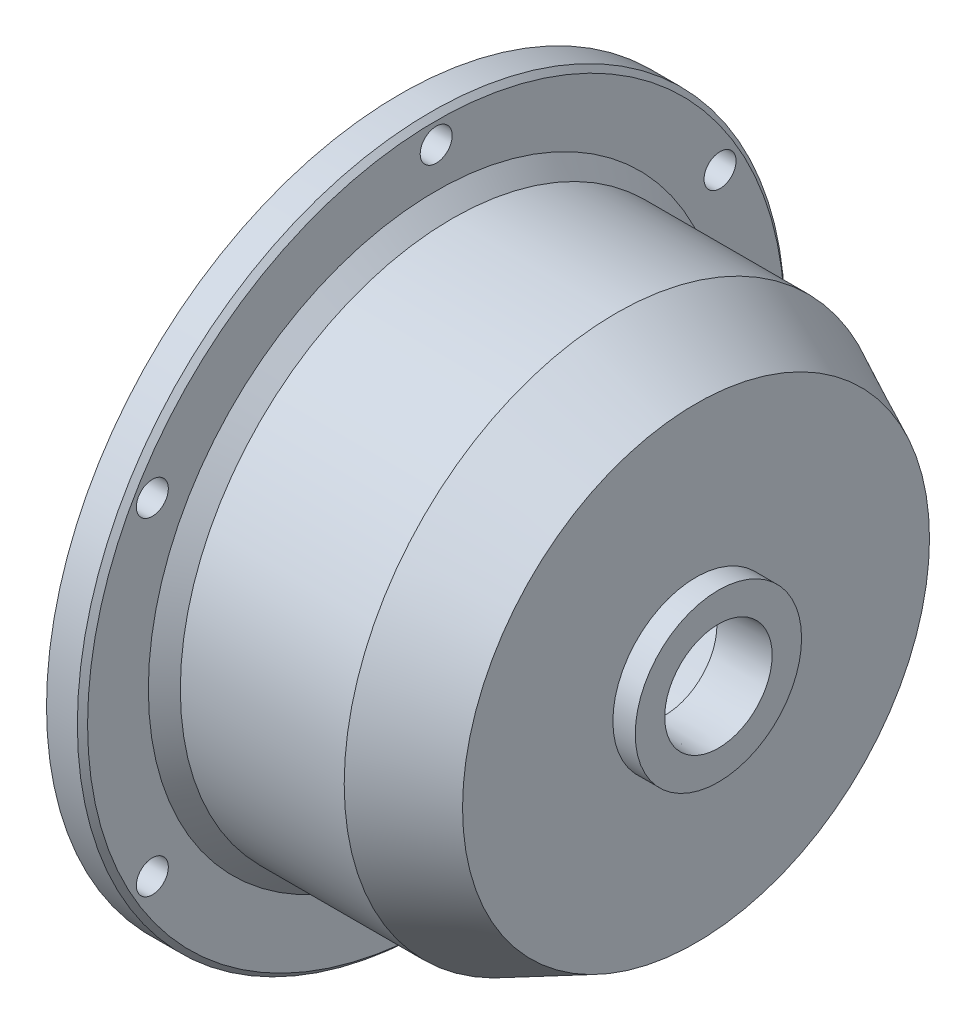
ISO-10303-21;
HEADER;
FILE_DESCRIPTION(('STEP AP214'),'2;1');
FILE_NAME('part.step','',(''),(''),'','','');
FILE_SCHEMA(('AUTOMOTIVE_DESIGN { 1 0 10303 214 1 1 1 1 }'));
ENDSEC;
DATA;
#1=APPLICATION_CONTEXT('core data for automotive mechanical design processes');
#2=APPLICATION_PROTOCOL_DEFINITION('international standard','automotive_design',2000,#1);
#3=PRODUCT_CONTEXT('',#1,'mechanical');
#4=PRODUCT('Part','Part','',(#3));
#5=PRODUCT_RELATED_PRODUCT_CATEGORY('part','',(#4));
#6=PRODUCT_DEFINITION_FORMATION('','',#4);
#7=PRODUCT_DEFINITION_CONTEXT('part definition',#1,'design');
#8=PRODUCT_DEFINITION('design','',#6,#7);
#9=PRODUCT_DEFINITION_SHAPE('','',#8);
#10=(LENGTH_UNIT() NAMED_UNIT(*) SI_UNIT(.MILLI.,.METRE.));
#11=(NAMED_UNIT(*) PLANE_ANGLE_UNIT() SI_UNIT($,.RADIAN.));
#12=(NAMED_UNIT(*) SI_UNIT($,.STERADIAN.) SOLID_ANGLE_UNIT());
#13=UNCERTAINTY_MEASURE_WITH_UNIT(LENGTH_MEASURE(1.E-05),#10,'distance_accuracy_value','');
#14=(GEOMETRIC_REPRESENTATION_CONTEXT(3) GLOBAL_UNCERTAINTY_ASSIGNED_CONTEXT((#13)) GLOBAL_UNIT_ASSIGNED_CONTEXT((#10,
#11,#12)) REPRESENTATION_CONTEXT('',''));
#15=CARTESIAN_POINT('',(0.,0.,0.));
#16=DIRECTION('',(0.,0.,1.));
#17=DIRECTION('',(1.,0.,0.));
#18=AXIS2_PLACEMENT_3D('',#15,#16,#17);
#19=CARTESIAN_POINT('',(68.2497999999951,46.3549999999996,0.));
#20=DIRECTION('',(-1.,0.,0.));
#21=DIRECTION('',(0.,0.,1.));
#22=AXIS2_PLACEMENT_3D('',#19,#20,#21);
#23=PLANE('',#22);
#24=CARTESIAN_POINT('',(68.249799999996,-4.05925293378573E-13,-1.59594559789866E-13));
#25=DIRECTION('',(-1.,0.,0.));
#26=DIRECTION('',(0.,0.,1.));
#27=AXIS2_PLACEMENT_3D('',#24,#25,#26);
#28=CIRCLE('',#27,46.355);
#29=CARTESIAN_POINT('',(68.2497999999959,-3.82947886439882E-13,46.355));
#30=VERTEX_POINT('',#29);
#31=EDGE_CURVE('E186',#30,#30,#28,.T.);
#32=ORIENTED_EDGE('',*,*,#31,.F.);
#33=EDGE_LOOP('',(#32));
#34=FACE_BOUND('',#33,.T.);
#35=CARTESIAN_POINT('',(68.249799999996,-4.05925293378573E-13,-1.59594559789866E-13));
#36=DIRECTION('',(-1.,0.,0.));
#37=DIRECTION('',(0.,0.,1.));
#38=AXIS2_PLACEMENT_3D('',#35,#36,#37);
#39=CIRCLE('',#38,16.51);
#40=CARTESIAN_POINT('',(68.249799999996,-3.97741559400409E-13,16.5099999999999));
#41=VERTEX_POINT('',#40);
#42=EDGE_CURVE('E10',#41,#41,#39,.F.);
#43=ORIENTED_EDGE('',*,*,#42,.F.);
#44=EDGE_LOOP('',(#43));
#45=FACE_BOUND('',#44,.T.);
#46=ADVANCED_FACE('F30',(#34,#45),#23,.F.);
#47=CARTESIAN_POINT('',(-8.88178419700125E-13,0.,0.));
#48=DIRECTION('',(-1.,0.,0.));
#49=DIRECTION('',(0.,0.,1.));
#50=AXIS2_PLACEMENT_3D('',#47,#48,#49);
#51=CYLINDRICAL_SURFACE('',#50,53.975);
#52=CARTESIAN_POINT('',(52.3747999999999,-3.2612801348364E-13,0.));
#53=DIRECTION('',(-1.,0.,0.));
#54=DIRECTION('',(0.,0.,1.));
#55=AXIS2_PLACEMENT_3D('',#52,#53,#54);
#56=CIRCLE('',#55,53.975);
#57=CARTESIAN_POINT('',(52.3747999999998,-2.99373498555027E-13,53.9750000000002));
#58=VERTEX_POINT('',#57);
#59=EDGE_CURVE('E183',#58,#58,#56,.T.);
#60=ORIENTED_EDGE('',*,*,#59,.T.);
#61=EDGE_LOOP('',(#60));
#62=FACE_BOUND('',#61,.T.);
#63=CARTESIAN_POINT('',(19.8373999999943,-1.31838984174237E-13,0.));
#64=DIRECTION('',(-1.,0.,0.));
#65=DIRECTION('',(0.,0.,1.));
#66=AXIS2_PLACEMENT_3D('',#63,#64,#65);
#67=CIRCLE('',#66,53.975);
#68=CARTESIAN_POINT('',(19.8373999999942,-1.05084469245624E-13,53.9750000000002));
#69=VERTEX_POINT('',#68);
#70=EDGE_CURVE('E118',#69,#69,#67,.F.);
#71=ORIENTED_EDGE('',*,*,#70,.T.);
#72=EDGE_LOOP('',(#71));
#73=FACE_BOUND('',#72,.T.);
#74=CARTESIAN_POINT('',(42.849799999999,-53.6001690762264,-6.35000000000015));
#75=CARTESIAN_POINT('',(43.0275402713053,-53.6001684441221,-6.3500019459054));
#76=CARTESIAN_POINT('',(43.205251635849,-53.6010549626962,-6.3425347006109));
#77=CARTESIAN_POINT('',(43.5594611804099,-53.6045743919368,-6.31272249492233));
#78=CARTESIAN_POINT('',(43.735959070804,-53.6072077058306,-6.29037409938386));
#79=CARTESIAN_POINT('',(44.0865558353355,-53.6141486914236,-6.23093702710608));
#80=CARTESIAN_POINT('',(44.2606527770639,-53.6184576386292,-6.19383712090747));
#81=CARTESIAN_POINT('',(44.605140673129,-53.6286275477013,-6.10515548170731));
#82=CARTESIAN_POINT('',(44.7755302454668,-53.6344890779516,-6.05356844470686));
#83=CARTESIAN_POINT('',(45.1111576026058,-53.6475886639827,-5.93635630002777));
#84=CARTESIAN_POINT('',(45.276400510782,-53.6548252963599,-5.87074569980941));
#85=CARTESIAN_POINT('',(45.6008191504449,-53.6704757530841,-5.72590272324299));
#86=CARTESIAN_POINT('',(45.7599926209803,-53.6788900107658,-5.64666533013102));
#87=CARTESIAN_POINT('',(46.0710109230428,-53.6966500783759,-5.47520009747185));
#88=CARTESIAN_POINT('',(46.2228597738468,-53.705995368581,-5.38297949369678));
#89=CARTESIAN_POINT('',(46.5183251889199,-53.7253614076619,-5.18613027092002));
#90=CARTESIAN_POINT('',(46.6619386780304,-53.735382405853,-5.08149706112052));
#91=CARTESIAN_POINT('',(46.9404451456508,-53.7558567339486,-4.86013300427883));
#92=CARTESIAN_POINT('',(47.0753002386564,-53.7663116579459,-4.74335463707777));
#93=CARTESIAN_POINT('',(47.3347553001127,-53.7873239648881,-4.49882932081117));
#94=CARTESIAN_POINT('',(47.4593514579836,-53.7978813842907,-4.37107833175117));
#95=CARTESIAN_POINT('',(47.6973234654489,-53.8187937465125,-4.10557984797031));
#96=CARTESIAN_POINT('',(47.8107028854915,-53.829148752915,-3.96783555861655));
#97=CARTESIAN_POINT('',(48.0255290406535,-53.8493718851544,-3.68322274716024));
#98=CARTESIAN_POINT('',(48.1269713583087,-53.8592398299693,-3.53635087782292));
#99=CARTESIAN_POINT('',(48.3173990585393,-53.8782308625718,-3.23416674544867));
#100=CARTESIAN_POINT('',(48.4063518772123,-53.8873519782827,-3.07883383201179));
#101=CARTESIAN_POINT('',(48.570881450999,-53.9045656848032,-2.76111364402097));
#102=CARTESIAN_POINT('',(48.6464532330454,-53.9126578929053,-2.59872377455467));
#103=CARTESIAN_POINT('',(48.7836029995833,-53.9275762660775,-2.26814345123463));
#104=CARTESIAN_POINT('',(48.8451865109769,-53.9344029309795,-2.09995531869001));
#105=CARTESIAN_POINT('',(48.9539627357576,-53.9466037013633,-1.75891861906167));
#106=CARTESIAN_POINT('',(49.0011501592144,-53.9519772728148,-1.58606836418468));
#107=CARTESIAN_POINT('',(49.120108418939,-53.9656219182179,-1.06411813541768));
#108=CARTESIAN_POINT('',(49.1700680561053,-53.9715060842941,-0.709701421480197));
#109=CARTESIAN_POINT('',(49.209817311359,-53.9761763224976,0.0023380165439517));
#110=CARTESIAN_POINT('',(49.1996090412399,-53.9749626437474,0.359960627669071));
#111=CARTESIAN_POINT('',(49.1196120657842,-53.9656105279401,1.06663214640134));
#112=CARTESIAN_POINT('',(49.0501181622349,-53.9575063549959,1.41571469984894));
#113=CARTESIAN_POINT('',(48.8539618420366,-53.9353193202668,2.09721396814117));
#114=CARTESIAN_POINT('',(48.7272984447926,-53.9212363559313,2.4296303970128));
#115=CARTESIAN_POINT('',(48.4200876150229,-53.8886161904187,3.06929631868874));
#116=CARTESIAN_POINT('',(48.2394116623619,-53.8700683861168,3.37648353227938));
#117=CARTESIAN_POINT('',(47.8293963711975,-53.8305953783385,3.95628707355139));
#118=CARTESIAN_POINT('',(47.6000550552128,-53.8096700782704,4.2289019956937));
#119=CARTESIAN_POINT('',(47.0975658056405,-53.7676364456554,4.7335544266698));
#120=CARTESIAN_POINT('',(46.8241610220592,-53.7465277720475,4.96533623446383));
#121=CARTESIAN_POINT('',(46.2421906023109,-53.7066319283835,5.37975779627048));
#122=CARTESIAN_POINT('',(45.9336248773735,-53.6878447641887,5.56239742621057));
#123=CARTESIAN_POINT('',(45.2898737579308,-53.6547188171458,5.87335982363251));
#124=CARTESIAN_POINT('',(44.9546791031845,-53.6403815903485,6.00166359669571));
#125=CARTESIAN_POINT('',(44.2672966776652,-53.6178098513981,6.20009319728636));
#126=CARTESIAN_POINT('',(43.9151096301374,-53.6095750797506,6.27022149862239));
#127=CARTESIAN_POINT('',(43.2059937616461,-53.6001873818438,6.34997392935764));
#128=CARTESIAN_POINT('',(42.8491058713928,-53.5989924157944,6.35995723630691));
#129=CARTESIAN_POINT('',(42.1387425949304,-53.6037085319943,6.32008258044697));
#130=CARTESIAN_POINT('',(41.7852671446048,-53.6096194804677,6.27022574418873));
#131=CARTESIAN_POINT('',(41.0928296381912,-53.6278430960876,6.11238789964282));
#132=CARTESIAN_POINT('',(40.7538276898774,-53.6401367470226,6.00457951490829));
#133=CARTESIAN_POINT('',(40.0987147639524,-53.6697251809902,5.73407599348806));
#134=CARTESIAN_POINT('',(39.7826045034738,-53.6870201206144,5.57137913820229));
#135=CARTESIAN_POINT('',(39.1806192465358,-53.7247635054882,5.19482900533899));
#136=CARTESIAN_POINT('',(38.8948929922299,-53.7452263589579,4.9807394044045));
#137=CARTESIAN_POINT('',(38.3633012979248,-53.7869540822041,4.50781526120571));
#138=CARTESIAN_POINT('',(38.1174372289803,-53.8082189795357,4.24897918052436));
#139=CARTESIAN_POINT('',(37.6712941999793,-53.849283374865,3.69234862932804));
#140=CARTESIAN_POINT('',(37.4712507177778,-53.8690749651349,3.39436477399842));
#141=CARTESIAN_POINT('',(37.1240556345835,-53.9048450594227,2.76880507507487));
#142=CARTESIAN_POINT('',(36.9769030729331,-53.9208236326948,2.44122976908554));
#143=CARTESIAN_POINT('',(36.7400524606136,-53.9471339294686,1.7666476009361));
#144=CARTESIAN_POINT('',(36.6502163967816,-53.9574792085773,1.41968962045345));
#145=CARTESIAN_POINT('',(36.5301238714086,-53.9714064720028,0.715289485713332));
#146=CARTESIAN_POINT('',(36.4998650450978,-53.9749887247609,0.357847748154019));
#147=CARTESIAN_POINT('',(36.4997677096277,-53.9750056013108,-0.176875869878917));
#148=CARTESIAN_POINT('',(36.5072090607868,-53.9741273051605,-0.354434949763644));
#149=CARTESIAN_POINT('',(36.5369314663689,-53.9706416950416,-0.708271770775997));
#150=CARTESIAN_POINT('',(36.559206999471,-53.96803502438,-0.884549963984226));
#151=CARTESIAN_POINT('',(36.6184508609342,-53.9611618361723,-1.23463975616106));
#152=CARTESIAN_POINT('',(36.6554245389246,-53.9568947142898,-1.40845043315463));
#153=CARTESIAN_POINT('',(36.7437731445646,-53.9468234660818,-1.75226196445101));
#154=CARTESIAN_POINT('',(36.7951428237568,-53.9410198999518,-1.92226418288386));
#155=CARTESIAN_POINT('',(36.9119206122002,-53.9280369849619,-2.2573370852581));
#156=CARTESIAN_POINT('',(36.977329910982,-53.9208575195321,-2.42240734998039));
#157=CARTESIAN_POINT('',(37.1216860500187,-53.9053269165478,-2.7463884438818));
#158=CARTESIAN_POINT('',(37.2006279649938,-53.8969762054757,-2.90530148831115));
#159=CARTESIAN_POINT('',(37.3715342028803,-53.8793308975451,-3.21598328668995));
#160=CARTESIAN_POINT('',(37.4635032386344,-53.8700359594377,-3.36774942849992));
#161=CARTESIAN_POINT('',(37.6597573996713,-53.8507672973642,-3.66297213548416));
#162=CARTESIAN_POINT('',(37.7640380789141,-53.8407938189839,-3.80643167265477));
#163=CARTESIAN_POINT('',(37.9848945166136,-53.8203796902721,-4.08496993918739));
#164=CARTESIAN_POINT('',(38.1015422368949,-53.8099365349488,-4.2199914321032));
#165=CARTESIAN_POINT('',(38.345732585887,-53.7889390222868,-4.47969125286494));
#166=CARTESIAN_POINT('',(38.4732712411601,-53.7783847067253,-4.60437332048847));
#167=CARTESIAN_POINT('',(38.7384702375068,-53.757452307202,-4.84265042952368));
#168=CARTESIAN_POINT('',(38.8761366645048,-53.7470743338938,-4.95623870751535));
#169=CARTESIAN_POINT('',(39.1605093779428,-53.726798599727,-5.17140349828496));
#170=CARTESIAN_POINT('',(39.307212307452,-53.716900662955,-5.27298443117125));
#171=CARTESIAN_POINT('',(39.609255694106,-53.6978254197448,-5.46382704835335));
#172=CARTESIAN_POINT('',(39.764626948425,-53.6886510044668,-5.55304029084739));
#173=CARTESIAN_POINT('',(40.0823365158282,-53.6713315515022,-5.71801314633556));
#174=CARTESIAN_POINT('',(40.2446722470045,-53.663186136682,-5.79377769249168));
#175=CARTESIAN_POINT('',(40.5750862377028,-53.6481616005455,-5.93128720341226));
#176=CARTESIAN_POINT('',(40.7431598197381,-53.6412814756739,-5.99304328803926));
#177=CARTESIAN_POINT('',(41.0839137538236,-53.6289798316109,-6.10214331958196));
#178=CARTESIAN_POINT('',(41.2565929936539,-53.6235579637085,-6.14949071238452));
#179=CARTESIAN_POINT('',(41.6633783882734,-53.612795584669,-6.24273196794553));
#180=CARTESIAN_POINT('',(41.8988327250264,-53.6080805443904,-6.28291693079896));
#181=CARTESIAN_POINT('',(42.3728087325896,-53.6017677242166,-6.33654955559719));
#182=CARTESIAN_POINT('',(42.611330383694,-53.6001699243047,-6.34999738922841));
#183=CARTESIAN_POINT('',(42.849799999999,-53.6001690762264,-6.35000000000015));
#184=B_SPLINE_CURVE_WITH_KNOTS('',3,(#74,#75,#76,#77,#78,#79,#80,#81,#82,#83,#84,#85,#86,#87,
#88,#89,#90,#91,#92,#93,#94,#95,#96,#97,#98,#99,#100,#101,#102,#103,#104,#105,#106,#107,#108,
#109,#110,#111,#112,#113,#114,#115,#116,#117,#118,#119,#120,#121,#122,#123,#124,#125,#126,#127,
#128,#129,#130,#131,#132,#133,#134,#135,#136,#137,#138,#139,#140,#141,#142,#143,#144,#145,#146,
#147,#148,#149,#150,#151,#152,#153,#154,#155,#156,#157,#158,#159,#160,#161,#162,#163,#164,#165,
#166,#167,#168,#169,#170,#171,#172,#173,#174,#175,#176,#177,#178,#179,#180,#181,#182,#183),
.UNSPECIFIED.,.T.,.F.,(4,2,2,2,2,2,2,2,2,2,2,2,2,2,2,2,2,2,2,2,2,2,2,2,2,2,2,2,2,2,2,2,2,2,2,2,
2,2,2,2,2,2,2,2,2,2,2,2,2,2,2,2,2,2,4),(0.,0.533012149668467,1.06614738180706,1.59968923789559,
2.13342668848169,2.66661463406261,3.19999929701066,3.73308786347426,4.26637421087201,
4.80183179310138,5.33748737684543,5.87297190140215,6.40865396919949,6.94570776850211,
7.4829607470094,8.02000108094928,8.55723851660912,9.62556291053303,10.6938498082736,
11.7568553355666,12.8198790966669,13.8854526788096,14.9510695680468,16.0231390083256,
17.0952111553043,18.1676577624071,19.2400587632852,20.3060491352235,21.3720194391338,
22.4348319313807,23.49767770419,24.5655077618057,25.6333745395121,26.7066118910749,
27.7798297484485,28.8504535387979,29.9210348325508,30.453667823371,30.9861026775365,
31.5187314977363,32.0511663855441,32.583646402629,33.1159330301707,33.6484127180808,
34.180700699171,34.7162763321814,35.2516573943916,35.7873628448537,36.3228704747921,
36.8604196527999,37.3977712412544,37.9346947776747,38.4714898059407,39.1866232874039,
39.901752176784),.UNSPECIFIED.);
#185=CARTESIAN_POINT('',(42.849799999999,-53.6001690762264,-6.35000000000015));
#186=VERTEX_POINT('',#185);
#187=EDGE_CURVE('E110',#186,#186,#184,.T.);
#188=ORIENTED_EDGE('',*,*,#187,.F.);
#189=EDGE_LOOP('',(#188));
#190=FACE_BOUND('',#189,.T.);
#191=ADVANCED_FACE('F121',(#62,#73,#190),#51,.T.);
#192=CARTESIAN_POINT('',(-4.88498130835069E-12,50.7999999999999,0.));
#193=DIRECTION('',(1.,0.,0.));
#194=DIRECTION('',(0.,0.,-1.));
#195=AXIS2_PLACEMENT_3D('',#192,#193,#194);
#196=PLANE('',#195);
#197=CARTESIAN_POINT('',(-8.88178419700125E-13,0.,0.));
#198=DIRECTION('',(1.,0.,0.));
#199=DIRECTION('',(0.,0.,-1.));
#200=AXIS2_PLACEMENT_3D('',#197,#198,#199);
#201=CIRCLE('',#200,55.2704);
#202=CARTESIAN_POINT('',(-7.89614951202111E-13,0.,-55.2704000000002));
#203=VERTEX_POINT('',#202);
#204=EDGE_CURVE('E201',#203,#203,#201,.F.);
#205=ORIENTED_EDGE('',*,*,#204,.T.);
#206=EDGE_LOOP('',(#205));
#207=FACE_BOUND('',#206,.T.);
#208=CARTESIAN_POINT('',(-8.88178419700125E-13,0.,0.));
#209=DIRECTION('',(-1.,0.,0.));
#210=DIRECTION('',(0.,0.,1.));
#211=AXIS2_PLACEMENT_3D('',#208,#209,#210);
#212=CIRCLE('',#211,50.8);
#213=CARTESIAN_POINT('',(-9.78769842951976E-13,0.,50.8000000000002));
#214=VERTEX_POINT('',#213);
#215=EDGE_CURVE('E205',#214,#214,#212,.T.);
#216=ORIENTED_EDGE('',*,*,#215,.F.);
#217=EDGE_LOOP('',(#216));
#218=FACE_BOUND('',#217,.T.);
#219=ADVANCED_FACE('F32',(#207,#218),#196,.F.);
#220=CARTESIAN_POINT('',(-8.88178419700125E-13,0.,0.));
#221=DIRECTION('',(-1.,0.,0.));
#222=DIRECTION('',(0.,0.,1.));
#223=AXIS2_PLACEMENT_3D('',#220,#221,#222);
#224=CYLINDRICAL_SURFACE('',#223,56.2864);
#225=CARTESIAN_POINT('',(2.92099999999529,0.,0.));
#226=DIRECTION('',(-1.,0.,0.));
#227=DIRECTION('',(0.,0.,1.));
#228=AXIS2_PLACEMENT_3D('',#225,#226,#227);
#229=CIRCLE('',#228,56.2864);
#230=CARTESIAN_POINT('',(2.92099999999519,0.,56.2864000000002));
#231=VERTEX_POINT('',#230);
#232=EDGE_CURVE('E92',#231,#231,#229,.T.);
#233=ORIENTED_EDGE('',*,*,#232,.T.);
#234=EDGE_LOOP('',(#233));
#235=FACE_BOUND('',#234,.T.);
#236=CARTESIAN_POINT('',(1.01599999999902,0.,0.));
#237=DIRECTION('',(1.,0.,0.));
#238=DIRECTION('',(0.,0.,-1.));
#239=AXIS2_PLACEMENT_3D('',#236,#237,#238);
#240=CIRCLE('',#239,56.2864);
#241=CARTESIAN_POINT('',(1.01599999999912,0.,-56.2864000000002));
#242=VERTEX_POINT('',#241);
#243=EDGE_CURVE('E209',#242,#242,#240,.T.);
#244=ORIENTED_EDGE('',*,*,#243,.T.);
#245=EDGE_LOOP('',(#244));
#246=FACE_BOUND('',#245,.T.);
#247=ADVANCED_FACE('F292',(#235,#246),#224,.T.);
#248=CARTESIAN_POINT('',(3.17499999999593,54.2036000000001,0.));
#249=DIRECTION('',(-1.,0.,0.));
#250=DIRECTION('',(0.,0.,1.));
#251=AXIS2_PLACEMENT_3D('',#248,#249,#250);
#252=PLANE('',#251);
#253=CARTESIAN_POINT('',(3.17499999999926,0.,0.));
#254=DIRECTION('',(-1.,0.,0.));
#255=DIRECTION('',(0.,0.,1.));
#256=AXIS2_PLACEMENT_3D('',#253,#254,#255);
#257=CIRCLE('',#256,56.0324);
#258=CARTESIAN_POINT('',(3.17499999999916,0.,56.0324000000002));
#259=VERTEX_POINT('',#258);
#260=EDGE_CURVE('E86',#259,#259,#257,.F.);
#261=ORIENTED_EDGE('',*,*,#260,.T.);
#262=EDGE_LOOP('',(#261));
#263=FACE_BOUND('',#262,.T.);
#264=CARTESIAN_POINT('',(3.17499999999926,0.,0.));
#265=DIRECTION('',(-1.,0.,0.));
#266=DIRECTION('',(0.,0.,1.));
#267=AXIS2_PLACEMENT_3D('',#264,#265,#266);
#268=CIRCLE('',#267,54.4576);
#269=CARTESIAN_POINT('',(3.17499999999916,0.,54.4576000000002));
#270=VERTEX_POINT('',#269);
#271=EDGE_CURVE('E89',#270,#270,#268,.T.);
#272=ORIENTED_EDGE('',*,*,#271,.T.);
#273=EDGE_LOOP('',(#272));
#274=FACE_BOUND('',#273,.T.);
#275=ADVANCED_FACE('F298',(#263,#274),#252,.F.);
#276=CARTESIAN_POINT('',(-8.88178419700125E-13,0.,0.));
#277=DIRECTION('',(-1.,0.,0.));
#278=DIRECTION('',(0.,0.,1.));
#279=AXIS2_PLACEMENT_3D('',#276,#277,#278);
#280=CYLINDRICAL_SURFACE('',#279,54.2036);
#281=CARTESIAN_POINT('',(6.52779999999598,0.,0.));
#282=DIRECTION('',(1.,0.,0.));
#283=DIRECTION('',(0.,0.,-1.));
#284=AXIS2_PLACEMENT_3D('',#281,#282,#283);
#285=CIRCLE('',#284,54.2036);
#286=CARTESIAN_POINT('',(6.52779999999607,0.,-54.2036000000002));
#287=VERTEX_POINT('',#286);
#288=EDGE_CURVE('E104',#287,#287,#285,.F.);
#289=ORIENTED_EDGE('',*,*,#288,.T.);
#290=EDGE_LOOP('',(#289));
#291=FACE_BOUND('',#290,.T.);
#292=CARTESIAN_POINT('',(3.42899999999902,0.,0.));
#293=DIRECTION('',(-1.,0.,0.));
#294=DIRECTION('',(0.,0.,1.));
#295=AXIS2_PLACEMENT_3D('',#292,#293,#294);
#296=CIRCLE('',#295,54.2036);
#297=CARTESIAN_POINT('',(3.42899999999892,0.,54.2036000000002));
#298=VERTEX_POINT('',#297);
#299=EDGE_CURVE('E107',#298,#298,#296,.F.);
#300=ORIENTED_EDGE('',*,*,#299,.T.);
#301=EDGE_LOOP('',(#300));
#302=FACE_BOUND('',#301,.T.);
#303=ADVANCED_FACE('F615',(#291,#302),#280,.T.);
#304=CARTESIAN_POINT('',(6.78179999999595,56.2864,0.));
#305=DIRECTION('',(1.,0.,0.));
#306=DIRECTION('',(0.,0.,-1.));
#307=AXIS2_PLACEMENT_3D('',#304,#305,#306);
#308=PLANE('',#307);
#309=CARTESIAN_POINT('',(6.78179999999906,0.,0.));
#310=DIRECTION('',(1.,0.,0.));
#311=DIRECTION('',(0.,0.,-1.));
#312=AXIS2_PLACEMENT_3D('',#309,#310,#311);
#313=CIRCLE('',#312,54.4576);
#314=CARTESIAN_POINT('',(6.78179999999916,0.,-54.4576000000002));
#315=VERTEX_POINT('',#314);
#316=EDGE_CURVE('E98',#315,#315,#313,.T.);
#317=ORIENTED_EDGE('',*,*,#316,.T.);
#318=EDGE_LOOP('',(#317));
#319=FACE_BOUND('',#318,.T.);
#320=CARTESIAN_POINT('',(6.78179999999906,0.,0.));
#321=DIRECTION('',(1.,0.,0.));
#322=DIRECTION('',(0.,0.,-1.));
#323=AXIS2_PLACEMENT_3D('',#320,#321,#322);
#324=CIRCLE('',#323,56.0324);
#325=CARTESIAN_POINT('',(6.78179999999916,0.,-56.0324000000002));
#326=VERTEX_POINT('',#325);
#327=EDGE_CURVE('E101',#326,#326,#324,.F.);
#328=ORIENTED_EDGE('',*,*,#327,.T.);
#329=EDGE_LOOP('',(#328));
#330=FACE_BOUND('',#329,.T.);
#331=ADVANCED_FACE('F605',(#319,#330),#308,.F.);
#332=CARTESIAN_POINT('',(-8.88178419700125E-13,0.,0.));
#333=DIRECTION('',(-1.,0.,0.));
#334=DIRECTION('',(0.,0.,1.));
#335=AXIS2_PLACEMENT_3D('',#332,#333,#334);
#336=CYLINDRICAL_SURFACE('',#335,56.2864);
#337=CARTESIAN_POINT('',(7.03579999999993,0.,0.));
#338=DIRECTION('',(1.,0.,0.));
#339=DIRECTION('',(0.,0.,-1.));
#340=AXIS2_PLACEMENT_3D('',#337,#338,#339);
#341=CIRCLE('',#340,56.2864);
#342=CARTESIAN_POINT('',(7.03580000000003,0.,-56.2864000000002));
#343=VERTEX_POINT('',#342);
#344=EDGE_CURVE('E95',#343,#343,#341,.T.);
#345=ORIENTED_EDGE('',*,*,#344,.T.);
#346=EDGE_LOOP('',(#345));
#347=FACE_BOUND('',#346,.T.);
#348=CARTESIAN_POINT('',(9.52500000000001,0.,0.));
#349=DIRECTION('',(-1.,0.,0.));
#350=DIRECTION('',(0.,0.,1.));
#351=AXIS2_PLACEMENT_3D('',#348,#349,#350);
#352=CIRCLE('',#351,56.2864);
#353=CARTESIAN_POINT('',(9.5249999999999,0.,56.2864000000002));
#354=VERTEX_POINT('',#353);
#355=EDGE_CURVE('E198',#354,#354,#352,.T.);
#356=ORIENTED_EDGE('',*,*,#355,.T.);
#357=EDGE_LOOP('',(#356));
#358=FACE_BOUND('',#357,.T.);
#359=ADVANCED_FACE('F595',(#347,#358),#336,.T.);
#360=CARTESIAN_POINT('',(9.52499999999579,57.912,0.));
#361=DIRECTION('',(1.,0.,0.));
#362=DIRECTION('',(0.,0.,-1.));
#363=AXIS2_PLACEMENT_3D('',#360,#361,#362);
#364=PLANE('',#363);
#365=CARTESIAN_POINT('',(9.52500000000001,0.,0.));
#366=DIRECTION('',(1.,0.,0.));
#367=DIRECTION('',(0.,0.,-1.));
#368=AXIS2_PLACEMENT_3D('',#365,#366,#367);
#369=CIRCLE('',#368,57.658);
#370=CARTESIAN_POINT('',(9.52500000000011,0.,-57.6580000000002));
#371=VERTEX_POINT('',#370);
#372=EDGE_CURVE('E71',#371,#371,#369,.F.);
#373=ORIENTED_EDGE('',*,*,#372,.T.);
#374=EDGE_LOOP('',(#373));
#375=FACE_BOUND('',#374,.T.);
#376=ORIENTED_EDGE('',*,*,#355,.F.);
#377=EDGE_LOOP('',(#376));
#378=FACE_BOUND('',#377,.T.);
#379=ADVANCED_FACE('F585',(#375,#378),#364,.F.);
#380=CARTESIAN_POINT('',(-8.88178419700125E-13,0.,0.));
#381=DIRECTION('',(-1.,0.,0.));
#382=DIRECTION('',(0.,0.,1.));
#383=AXIS2_PLACEMENT_3D('',#380,#381,#382);
#384=CYLINDRICAL_SURFACE('',#383,57.912);
#385=CARTESIAN_POINT('',(9.7789999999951,0.,0.));
#386=DIRECTION('',(1.,0.,0.));
#387=DIRECTION('',(0.,0.,-1.));
#388=AXIS2_PLACEMENT_3D('',#385,#386,#387);
#389=CIRCLE('',#388,57.912);
#390=CARTESIAN_POINT('',(9.7789999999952,-1.11972747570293E-13,-57.9120000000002));
#391=VERTEX_POINT('',#390);
#392=EDGE_CURVE('E42',#391,#391,#389,.T.);
#393=ORIENTED_EDGE('',*,*,#392,.T.);
#394=EDGE_LOOP('',(#393));
#395=FACE_BOUND('',#394,.T.);
#396=CARTESIAN_POINT('',(10.5409999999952,0.,0.));
#397=DIRECTION('',(1.,0.,0.));
#398=DIRECTION('',(0.,0.,-1.));
#399=AXIS2_PLACEMENT_3D('',#396,#397,#398);
#400=CIRCLE('',#399,57.912);
#401=CARTESIAN_POINT('',(10.5409999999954,-1.17176917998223E-13,-57.9120000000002));
#402=VERTEX_POINT('',#401);
#403=EDGE_CURVE('E68',#402,#402,#400,.F.);
#404=ORIENTED_EDGE('',*,*,#403,.T.);
#405=EDGE_LOOP('',(#404));
#406=FACE_BOUND('',#405,.T.);
#407=ADVANCED_FACE('F575',(#395,#406),#384,.T.);
#408=CARTESIAN_POINT('',(10.7949999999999,60.2487999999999,0.));
#409=DIRECTION('',(1.,0.,0.));
#410=DIRECTION('',(0.,0.,-1.));
#411=AXIS2_PLACEMENT_3D('',#408,#409,#410);
#412=PLANE('',#411);
#413=CARTESIAN_POINT('',(10.7949999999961,0.,0.));
#414=DIRECTION('',(1.,0.,0.));
#415=DIRECTION('',(0.,0.,-1.));
#416=AXIS2_PLACEMENT_3D('',#413,#414,#415);
#417=CIRCLE('',#416,58.166);
#418=CARTESIAN_POINT('',(10.7949999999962,-1.03425033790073E-13,-58.1660000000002));
#419=VERTEX_POINT('',#418);
#420=EDGE_CURVE('E38',#419,#419,#417,.T.);
#421=ORIENTED_EDGE('',*,*,#420,.T.);
#422=EDGE_LOOP('',(#421));
#423=FACE_BOUND('',#422,.T.);
#424=CARTESIAN_POINT('',(10.7949999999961,0.,0.));
#425=DIRECTION('',(1.,0.,0.));
#426=DIRECTION('',(0.,0.,-1.));
#427=AXIS2_PLACEMENT_3D('',#424,#425,#426);
#428=CIRCLE('',#427,59.9948);
#429=CARTESIAN_POINT('',(10.7949999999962,-1.04331539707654E-13,-59.9948000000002));
#430=VERTEX_POINT('',#429);
#431=EDGE_CURVE('E74',#430,#430,#428,.F.);
#432=ORIENTED_EDGE('',*,*,#431,.T.);
#433=EDGE_LOOP('',(#432));
#434=FACE_BOUND('',#433,.T.);
#435=ADVANCED_FACE('F565',(#423,#434),#412,.F.);
#436=CARTESIAN_POINT('',(-8.88178419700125E-13,0.,0.));
#437=DIRECTION('',(-1.,0.,0.));
#438=DIRECTION('',(0.,0.,1.));
#439=AXIS2_PLACEMENT_3D('',#436,#437,#438);
#440=CYLINDRICAL_SURFACE('',#439,60.2488);
#441=CARTESIAN_POINT('',(9.7789999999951,0.,0.));
#442=DIRECTION('',(1.,0.,0.));
#443=DIRECTION('',(0.,0.,-1.));
#444=AXIS2_PLACEMENT_3D('',#441,#442,#443);
#445=CIRCLE('',#444,60.2488);
#446=CARTESIAN_POINT('',(9.77899999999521,-1.13131060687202E-13,-60.2488000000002));
#447=VERTEX_POINT('',#446);
#448=EDGE_CURVE('E80',#447,#447,#445,.F.);
#449=ORIENTED_EDGE('',*,*,#448,.T.);
#450=EDGE_LOOP('',(#449));
#451=FACE_BOUND('',#450,.T.);
#452=CARTESIAN_POINT('',(10.5409999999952,0.,0.));
#453=DIRECTION('',(1.,0.,0.));
#454=DIRECTION('',(0.,0.,-1.));
#455=AXIS2_PLACEMENT_3D('',#452,#453,#454);
#456=CIRCLE('',#455,60.2488);
#457=CARTESIAN_POINT('',(10.5409999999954,-1.18335231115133E-13,-60.2488000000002));
#458=VERTEX_POINT('',#457);
#459=EDGE_CURVE('E83',#458,#458,#456,.T.);
#460=ORIENTED_EDGE('',*,*,#459,.T.);
#461=EDGE_LOOP('',(#460));
#462=FACE_BOUND('',#461,.T.);
#463=ADVANCED_FACE('F555',(#451,#462),#440,.F.);
#464=CARTESIAN_POINT('',(9.52499999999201,60.2487999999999,0.));
#465=DIRECTION('',(1.,0.,0.));
#466=DIRECTION('',(0.,0.,-1.));
#467=AXIS2_PLACEMENT_3D('',#464,#465,#466);
#468=PLANE('',#467);
#469=CARTESIAN_POINT('',(9.52499999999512,32.5374000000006,56.3564299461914));
#470=DIRECTION('',(-1.,0.,0.));
#471=DIRECTION('',(0.,-0.866025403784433,0.500000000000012));
#472=AXIS2_PLACEMENT_3D('',#469,#470,#471);
#473=CIRCLE('',#472,3.175);
#474=CARTESIAN_POINT('',(9.52499999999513,29.787769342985,57.9439299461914));
#475=VERTEX_POINT('',#474);
#476=EDGE_CURVE('E49',#475,#475,#473,.T.);
#477=ORIENTED_EDGE('',*,*,#476,.F.);
#478=EDGE_LOOP('',(#477));
#479=FACE_BOUND('',#478,.T.);
#480=CARTESIAN_POINT('',(9.52499999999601,-32.5373999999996,56.3564299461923));
#481=DIRECTION('',(-1.,0.,0.));
#482=DIRECTION('',(0.,-0.866025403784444,-0.499999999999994));
#483=AXIS2_PLACEMENT_3D('',#480,#481,#482);
#484=CIRCLE('',#483,3.175);
#485=CARTESIAN_POINT('',(9.52499999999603,-35.2870306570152,54.7689299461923));
#486=VERTEX_POINT('',#485);
#487=EDGE_CURVE('E48',#486,#486,#484,.T.);
#488=ORIENTED_EDGE('',*,*,#487,.F.);
#489=EDGE_LOOP('',(#488));
#490=FACE_BOUND('',#489,.T.);
#491=CARTESIAN_POINT('',(9.52500000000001,-65.0747999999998,4.5102810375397E-13));
#492=DIRECTION('',(-1.,0.,0.));
#493=DIRECTION('',(0.,0.,-1.));
#494=AXIS2_PLACEMENT_3D('',#491,#492,#493);
#495=CIRCLE('',#494,3.175);
#496=CARTESIAN_POINT('',(9.52500000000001,-65.0747999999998,-3.17499999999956));
#497=VERTEX_POINT('',#496);
#498=EDGE_CURVE('E53',#497,#497,#495,.T.);
#499=ORIENTED_EDGE('',*,*,#498,.F.);
#500=EDGE_LOOP('',(#499));
#501=FACE_BOUND('',#500,.T.);
#502=CARTESIAN_POINT('',(9.5249999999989,-32.5374000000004,-56.3564299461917));
#503=DIRECTION('',(-1.,0.,0.));
#504=DIRECTION('',(0.,0.866025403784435,-0.500000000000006));
#505=AXIS2_PLACEMENT_3D('',#502,#503,#504);
#506=CIRCLE('',#505,3.175);
#507=CARTESIAN_POINT('',(9.52499999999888,-29.7877693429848,-57.9439299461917));
#508=VERTEX_POINT('',#507);
#509=EDGE_CURVE('E57',#508,#508,#506,.T.);
#510=ORIENTED_EDGE('',*,*,#509,.F.);
#511=EDGE_LOOP('',(#510));
#512=FACE_BOUND('',#511,.T.);
#513=CARTESIAN_POINT('',(9.52499999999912,32.5373999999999,-56.3564299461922));
#514=DIRECTION('',(-1.,0.,0.));
#515=DIRECTION('',(0.,0.86602540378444,0.5));
#516=AXIS2_PLACEMENT_3D('',#513,#514,#515);
#517=CIRCLE('',#516,3.175);
#518=CARTESIAN_POINT('',(9.5249999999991,35.2870306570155,-54.7689299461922));
#519=VERTEX_POINT('',#518);
#520=EDGE_CURVE('E61',#519,#519,#517,.T.);
#521=ORIENTED_EDGE('',*,*,#520,.F.);
#522=EDGE_LOOP('',(#521));
#523=FACE_BOUND('',#522,.T.);
#524=CARTESIAN_POINT('',(9.52500000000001,0.,0.));
#525=DIRECTION('',(1.,0.,0.));
#526=DIRECTION('',(0.,0.,-1.));
#527=AXIS2_PLACEMENT_3D('',#524,#525,#526);
#528=CIRCLE('',#527,60.5028);
#529=CARTESIAN_POINT('',(9.52500000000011,0.,-60.5028000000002));
#530=VERTEX_POINT('',#529);
#531=EDGE_CURVE('E77',#530,#530,#528,.T.);
#532=ORIENTED_EDGE('',*,*,#531,.T.);
#533=EDGE_LOOP('',(#532));
#534=FACE_BOUND('',#533,.T.);
#535=CARTESIAN_POINT('',(9.52499999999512,65.0748,0.));
#536=DIRECTION('',(-1.,0.,0.));
#537=DIRECTION('',(0.,0.,1.));
#538=AXIS2_PLACEMENT_3D('',#535,#536,#537);
#539=CIRCLE('',#538,3.175);
#540=CARTESIAN_POINT('',(9.52499999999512,65.0748,3.17500000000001));
#541=VERTEX_POINT('',#540);
#542=EDGE_CURVE('E206',#541,#541,#539,.T.);
#543=ORIENTED_EDGE('',*,*,#542,.F.);
#544=EDGE_LOOP('',(#543));
#545=FACE_BOUND('',#544,.T.);
#546=CARTESIAN_POINT('',(9.52500000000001,0.,0.));
#547=DIRECTION('',(-1.,0.,0.));
#548=DIRECTION('',(0.,0.,1.));
#549=AXIS2_PLACEMENT_3D('',#546,#547,#548);
#550=CIRCLE('',#549,70.231);
#551=CARTESIAN_POINT('',(9.52499999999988,0.,70.2310000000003));
#552=VERTEX_POINT('',#551);
#553=EDGE_CURVE('E189',#552,#552,#550,.T.);
#554=ORIENTED_EDGE('',*,*,#553,.T.);
#555=EDGE_LOOP('',(#554));
#556=FACE_BOUND('',#555,.T.);
#557=ADVANCED_FACE('F545',(#479,#490,#501,#512,#523,#534,#545,#556),#468,.F.);
#558=CARTESIAN_POINT('',(-8.88178419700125E-13,0.,0.));
#559=DIRECTION('',(-1.,0.,0.));
#560=DIRECTION('',(0.,0.,1.));
#561=AXIS2_PLACEMENT_3D('',#558,#559,#560);
#562=CYLINDRICAL_SURFACE('',#561,70.231);
#563=CARTESIAN_POINT('',(15.6463999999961,-1.09287578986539E-13,0.));
#564=DIRECTION('',(-1.,0.,0.));
#565=DIRECTION('',(0.,0.,1.));
#566=AXIS2_PLACEMENT_3D('',#563,#564,#565);
#567=CIRCLE('',#566,70.231);
#568=CARTESIAN_POINT('',(15.6463999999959,0.,70.2310000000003));
#569=VERTEX_POINT('',#568);
#570=EDGE_CURVE('E212',#569,#569,#567,.T.);
#571=ORIENTED_EDGE('',*,*,#570,.T.);
#572=EDGE_LOOP('',(#571));
#573=FACE_BOUND('',#572,.T.);
#574=ORIENTED_EDGE('',*,*,#553,.F.);
#575=EDGE_LOOP('',(#574));
#576=FACE_BOUND('',#575,.T.);
#577=ADVANCED_FACE('F178',(#573,#576),#562,.T.);
#578=CARTESIAN_POINT('',(16.6623999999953,70.231,0.));
#579=DIRECTION('',(-1.,0.,0.));
#580=DIRECTION('',(0.,0.,1.));
#581=AXIS2_PLACEMENT_3D('',#578,#579,#580);
#582=PLANE('',#581);
#583=CARTESIAN_POINT('',(16.662399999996,32.5374000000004,56.3564299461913));
#584=DIRECTION('',(-1.,0.,0.));
#585=DIRECTION('',(0.,0.,1.));
#586=AXIS2_PLACEMENT_3D('',#583,#584,#585);
#587=CIRCLE('',#586,3.175);
#588=CARTESIAN_POINT('',(16.662399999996,32.5374000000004,59.5314299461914));
#589=VERTEX_POINT('',#588);
#590=EDGE_CURVE('E45',#589,#589,#587,.T.);
#591=ORIENTED_EDGE('',*,*,#590,.T.);
#592=EDGE_LOOP('',(#591));
#593=FACE_BOUND('',#592,.T.);
#594=CARTESIAN_POINT('',(16.6624,-32.5373999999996,56.3564299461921));
#595=DIRECTION('',(-1.,0.,0.));
#596=DIRECTION('',(0.,0.,1.));
#597=AXIS2_PLACEMENT_3D('',#594,#595,#596);
#598=CIRCLE('',#597,3.175);
#599=CARTESIAN_POINT('',(16.6624,-32.5373999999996,59.5314299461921));
#600=VERTEX_POINT('',#599);
#601=EDGE_CURVE('E50',#600,#600,#598,.T.);
#602=ORIENTED_EDGE('',*,*,#601,.T.);
#603=EDGE_LOOP('',(#602));
#604=FACE_BOUND('',#603,.T.);
#605=CARTESIAN_POINT('',(16.6623999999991,-65.0748,4.30211422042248E-13));
#606=DIRECTION('',(-1.,0.,0.));
#607=DIRECTION('',(0.,0.,1.));
#608=AXIS2_PLACEMENT_3D('',#605,#606,#607);
#609=CIRCLE('',#608,3.175);
#610=CARTESIAN_POINT('',(16.6623999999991,-65.0748,3.17500000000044));
#611=VERTEX_POINT('',#610);
#612=EDGE_CURVE('E54',#611,#611,#609,.T.);
#613=ORIENTED_EDGE('',*,*,#612,.T.);
#614=EDGE_LOOP('',(#613));
#615=FACE_BOUND('',#614,.T.);
#616=CARTESIAN_POINT('',(16.6624,-32.5374000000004,-56.3564299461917));
#617=DIRECTION('',(-1.,0.,0.));
#618=DIRECTION('',(0.,0.,1.));
#619=AXIS2_PLACEMENT_3D('',#616,#617,#618);
#620=CIRCLE('',#619,3.175);
#621=CARTESIAN_POINT('',(16.6624,-32.5374000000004,-53.1814299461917));
#622=VERTEX_POINT('',#621);
#623=EDGE_CURVE('E58',#622,#622,#620,.T.);
#624=ORIENTED_EDGE('',*,*,#623,.T.);
#625=EDGE_LOOP('',(#624));
#626=FACE_BOUND('',#625,.T.);
#627=CARTESIAN_POINT('',(16.662399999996,32.5373999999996,-56.3564299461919));
#628=DIRECTION('',(-1.,0.,0.));
#629=DIRECTION('',(0.,0.,1.));
#630=AXIS2_PLACEMENT_3D('',#627,#628,#629);
#631=CIRCLE('',#630,3.175);
#632=CARTESIAN_POINT('',(16.662399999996,32.5373999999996,-53.1814299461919));
#633=VERTEX_POINT('',#632);
#634=EDGE_CURVE('E62',#633,#633,#631,.T.);
#635=ORIENTED_EDGE('',*,*,#634,.T.);
#636=EDGE_LOOP('',(#635));
#637=FACE_BOUND('',#636,.T.);
#638=CARTESIAN_POINT('',(16.662399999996,-1.16226472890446E-13,0.));
#639=DIRECTION('',(-1.,0.,0.));
#640=DIRECTION('',(0.,0.,1.));
#641=AXIS2_PLACEMENT_3D('',#638,#639,#640);
#642=CIRCLE('',#641,57.15);
#643=CARTESIAN_POINT('',(16.6623999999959,0.,57.1500000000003));
#644=VERTEX_POINT('',#643);
#645=EDGE_CURVE('E217',#644,#644,#642,.T.);
#646=ORIENTED_EDGE('',*,*,#645,.T.);
#647=EDGE_LOOP('',(#646));
#648=FACE_BOUND('',#647,.T.);
#649=CARTESIAN_POINT('',(16.662399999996,-1.16226472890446E-13,0.));
#650=DIRECTION('',(-1.,0.,0.));
#651=DIRECTION('',(0.,0.,1.));
#652=AXIS2_PLACEMENT_3D('',#649,#650,#651);
#653=CIRCLE('',#652,69.215);
#654=CARTESIAN_POINT('',(16.6623999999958,0.,69.2150000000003));
#655=VERTEX_POINT('',#654);
#656=EDGE_CURVE('E215',#655,#655,#653,.F.);
#657=ORIENTED_EDGE('',*,*,#656,.T.);
#658=EDGE_LOOP('',(#657));
#659=FACE_BOUND('',#658,.T.);
#660=CARTESIAN_POINT('',(16.6623999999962,65.0747999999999,0.));
#661=DIRECTION('',(-1.,0.,0.));
#662=DIRECTION('',(0.,0.,1.));
#663=AXIS2_PLACEMENT_3D('',#660,#661,#662);
#664=CIRCLE('',#663,3.175);
#665=CARTESIAN_POINT('',(16.6623999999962,65.0747999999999,3.17500000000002));
#666=VERTEX_POINT('',#665);
#667=EDGE_CURVE('E202',#666,#666,#664,.T.);
#668=ORIENTED_EDGE('',*,*,#667,.T.);
#669=EDGE_LOOP('',(#668));
#670=FACE_BOUND('',#669,.T.);
#671=ADVANCED_FACE('F173',(#593,#604,#615,#626,#637,#648,#659,#670),#582,.F.);
#672=CARTESIAN_POINT('',(68.249799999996,-4.05925293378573E-13,-1.59594559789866E-13));
#673=DIRECTION('',(-1.,0.,0.));
#674=DIRECTION('',(0.,0.,1.));
#675=AXIS2_PLACEMENT_3D('',#672,#673,#674);
#676=CONICAL_SURFACE('',#675,46.355,0.44751997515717);
#677=ORIENTED_EDGE('',*,*,#59,.F.);
#678=EDGE_LOOP('',(#677));
#679=FACE_BOUND('',#678,.T.);
#680=ORIENTED_EDGE('',*,*,#31,.T.);
#681=EDGE_LOOP('',(#680));
#682=FACE_BOUND('',#681,.T.);
#683=ADVANCED_FACE('F168',(#679,#682),#676,.T.);
#684=CARTESIAN_POINT('',(62.0521999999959,40.6399999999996,-1.04083408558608E-13));
#685=DIRECTION('',(1.,0.,0.));
#686=DIRECTION('',(0.,0.,-1.));
#687=AXIS2_PLACEMENT_3D('',#684,#685,#686);
#688=PLANE('',#687);
#689=CARTESIAN_POINT('',(62.0521999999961,-3.85108611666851E-13,0.));
#690=DIRECTION('',(1.,0.,0.));
#691=DIRECTION('',(0.,0.,-1.));
#692=AXIS2_PLACEMENT_3D('',#689,#690,#691);
#693=CIRCLE('',#692,10.3493336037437);
#694=CARTESIAN_POINT('',(62.0521999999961,-3.90238605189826E-13,-10.3493336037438));
#695=VERTEX_POINT('',#694);
#696=EDGE_CURVE('E34',#695,#695,#693,.T.);
#697=ORIENTED_EDGE('',*,*,#696,.T.);
#698=EDGE_LOOP('',(#697));
#699=FACE_BOUND('',#698,.T.);
#700=CARTESIAN_POINT('',(62.0521999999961,-3.85108611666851E-13,0.));
#701=DIRECTION('',(-1.,0.,0.));
#702=DIRECTION('',(0.,0.,1.));
#703=AXIS2_PLACEMENT_3D('',#700,#701,#702);
#704=CIRCLE('',#703,40.64);
#705=CARTESIAN_POINT('',(62.052199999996,-3.64964035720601E-13,40.6400000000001));
#706=VERTEX_POINT('',#705);
#707=EDGE_CURVE('E187',#706,#706,#704,.T.);
#708=ORIENTED_EDGE('',*,*,#707,.T.);
#709=EDGE_LOOP('',(#708));
#710=FACE_BOUND('',#709,.T.);
#711=ADVANCED_FACE('F164',(#699,#710),#688,.F.);
#712=CARTESIAN_POINT('',(-8.88178419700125E-13,0.,0.));
#713=DIRECTION('',(-1.,0.,0.));
#714=DIRECTION('',(0.,0.,1.));
#715=AXIS2_PLACEMENT_3D('',#712,#713,#714);
#716=CYLINDRICAL_SURFACE('',#715,40.64);
#717=ORIENTED_EDGE('',*,*,#707,.F.);
#718=EDGE_LOOP('',(#717));
#719=FACE_BOUND('',#718,.T.);
#720=CARTESIAN_POINT('',(52.400199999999,-3.24393290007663E-13,0.));
#721=DIRECTION('',(-1.,0.,0.));
#722=DIRECTION('',(0.,0.,1.));
#723=AXIS2_PLACEMENT_3D('',#720,#721,#722);
#724=CIRCLE('',#723,40.64);
#725=CARTESIAN_POINT('',(52.4001999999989,-3.04248714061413E-13,40.6400000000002));
#726=VERTEX_POINT('',#725);
#727=EDGE_CURVE('E192',#726,#726,#724,.T.);
#728=ORIENTED_EDGE('',*,*,#727,.T.);
#729=EDGE_LOOP('',(#728));
#730=FACE_BOUND('',#729,.T.);
#731=ADVANCED_FACE('F160',(#719,#730),#716,.F.);
#732=CARTESIAN_POINT('',(52.4001999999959,50.7999999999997,0.));
#733=DIRECTION('',(1.,0.,0.));
#734=DIRECTION('',(0.,0.,-1.));
#735=AXIS2_PLACEMENT_3D('',#732,#733,#734);
#736=PLANE('',#735);
#737=CARTESIAN_POINT('',(52.4001999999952,-38.4948291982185,22.2250000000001));
#738=DIRECTION('',(-1.,0.,0.));
#739=DIRECTION('',(0.,0.,1.));
#740=AXIS2_PLACEMENT_3D('',#737,#738,#739);
#741=CIRCLE('',#740,1.7526);
#742=CARTESIAN_POINT('',(52.4001999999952,-38.4948291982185,23.9776000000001));
#743=VERTEX_POINT('',#742);
#744=EDGE_CURVE('E147',#743,#743,#741,.T.);
#745=ORIENTED_EDGE('',*,*,#744,.F.);
#746=EDGE_LOOP('',(#745));
#747=FACE_BOUND('',#746,.T.);
#748=CARTESIAN_POINT('',(52.4001999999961,38.4948291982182,22.2249999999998));
#749=DIRECTION('',(-1.,0.,0.));
#750=DIRECTION('',(0.,0.,1.));
#751=AXIS2_PLACEMENT_3D('',#748,#749,#750);
#752=CIRCLE('',#751,1.7526);
#753=CARTESIAN_POINT('',(52.4001999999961,38.4948291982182,23.9775999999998));
#754=VERTEX_POINT('',#753);
#755=EDGE_CURVE('E266',#754,#754,#752,.T.);
#756=ORIENTED_EDGE('',*,*,#755,.F.);
#757=EDGE_LOOP('',(#756));
#758=FACE_BOUND('',#757,.T.);
#759=ORIENTED_EDGE('',*,*,#727,.F.);
#760=EDGE_LOOP('',(#759));
#761=FACE_BOUND('',#760,.T.);
#762=CARTESIAN_POINT('',(52.400199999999,-3.24393290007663E-13,0.));
#763=DIRECTION('',(-1.,0.,0.));
#764=DIRECTION('',(0.,0.,1.));
#765=AXIS2_PLACEMENT_3D('',#762,#763,#764);
#766=CIRCLE('',#765,50.8);
#767=CARTESIAN_POINT('',(52.4001999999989,-2.99212570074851E-13,50.8000000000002));
#768=VERTEX_POINT('',#767);
#769=EDGE_CURVE('E279',#768,#768,#766,.T.);
#770=ORIENTED_EDGE('',*,*,#769,.T.);
#771=EDGE_LOOP('',(#770));
#772=FACE_BOUND('',#771,.T.);
#773=ADVANCED_FACE('F155',(#747,#758,#761,#772),#736,.F.);
#774=CARTESIAN_POINT('',(-8.88178419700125E-13,0.,0.));
#775=DIRECTION('',(-1.,0.,0.));
#776=DIRECTION('',(0.,0.,1.));
#777=AXIS2_PLACEMENT_3D('',#774,#775,#776);
#778=CYLINDRICAL_SURFACE('',#777,50.8);
#779=CARTESIAN_POINT('',(42.8497999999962,-50.7426588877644,2.41299999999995));
#780=CARTESIAN_POINT('',(42.7143427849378,-50.7426596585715,2.41299401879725));
#781=CARTESIAN_POINT('',(42.5787892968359,-50.7432071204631,2.40155556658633));
#782=CARTESIAN_POINT('',(42.3114211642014,-50.7453382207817,2.35608719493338));
#783=CARTESIAN_POINT('',(42.1796111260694,-50.7469230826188,2.32203060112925));
#784=CARTESIAN_POINT('',(41.9236417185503,-50.7509490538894,2.23230269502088));
#785=CARTESIAN_POINT('',(41.7994785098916,-50.7533897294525,2.17664233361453));
#786=CARTESIAN_POINT('',(41.5622914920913,-50.7588517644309,2.04530353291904));
#787=CARTESIAN_POINT('',(41.4492650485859,-50.7618729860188,1.96962984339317));
#788=CARTESIAN_POINT('',(41.2374213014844,-50.7681588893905,1.80033399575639));
#789=CARTESIAN_POINT('',(41.1386155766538,-50.7714237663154,1.70669735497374));
#790=CARTESIAN_POINT('',(40.9581166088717,-50.7778272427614,1.50416226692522));
#791=CARTESIAN_POINT('',(40.8764240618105,-50.7809658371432,1.39526319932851));
#792=CARTESIAN_POINT('',(40.7324396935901,-50.786764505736,1.1652353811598));
#793=CARTESIAN_POINT('',(40.6701567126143,-50.7894243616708,1.04410109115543));
#794=CARTESIAN_POINT('',(40.5668162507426,-50.7939638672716,0.793080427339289));
#795=CARTESIAN_POINT('',(40.5257586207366,-50.7958435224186,0.663194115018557));
#796=CARTESIAN_POINT('',(40.4660644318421,-50.7986095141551,0.398461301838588));
#797=CARTESIAN_POINT('',(40.4474108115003,-50.7994966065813,0.263618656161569));
#798=CARTESIAN_POINT('',(40.4330015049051,-50.8001800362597,-0.00728670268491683));
#799=CARTESIAN_POINT('',(40.4372456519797,-50.7999763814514,-0.143349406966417));
#800=CARTESIAN_POINT('',(40.4684972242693,-50.7985019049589,-0.412717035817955));
#801=CARTESIAN_POINT('',(40.4954862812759,-50.797231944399,-0.546024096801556));
#802=CARTESIAN_POINT('',(40.5714330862,-50.7937689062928,-0.806213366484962));
#803=CARTESIAN_POINT('',(40.6203909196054,-50.7915758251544,-0.933095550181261));
#804=CARTESIAN_POINT('',(40.7389065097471,-50.7865121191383,-1.17689250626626));
#805=CARTESIAN_POINT('',(40.8084726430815,-50.7836412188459,-1.29380320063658));
#806=CARTESIAN_POINT('',(40.9662239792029,-50.7775452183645,-1.51429392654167));
#807=CARTESIAN_POINT('',(41.0544092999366,-50.7743201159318,-1.6178738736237));
#808=CARTESIAN_POINT('',(41.2469996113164,-50.7678751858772,-1.80886996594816));
#809=CARTESIAN_POINT('',(41.3514205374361,-50.7646553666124,-1.89627004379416));
#810=CARTESIAN_POINT('',(41.5734619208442,-50.7585872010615,-2.05230166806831));
#811=CARTESIAN_POINT('',(41.691082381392,-50.7557388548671,-2.12093320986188));
#812=CARTESIAN_POINT('',(41.9361936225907,-50.7507350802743,-2.23747811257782));
#813=CARTESIAN_POINT('',(42.0636846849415,-50.7485796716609,-2.28539088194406));
#814=CARTESIAN_POINT('',(42.3249137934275,-50.7452056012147,-2.3591275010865));
#815=CARTESIAN_POINT('',(42.4586517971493,-50.743986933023,-2.38495150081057));
#816=CARTESIAN_POINT('',(42.7284385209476,-50.7426249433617,-2.4137576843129));
#817=CARTESIAN_POINT('',(42.8644848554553,-50.7424805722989,-2.41676216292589));
#818=CARTESIAN_POINT('',(43.1351493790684,-50.7432807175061,-2.39990218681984));
#819=CARTESIAN_POINT('',(43.269767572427,-50.7442252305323,-2.38003780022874));
#820=CARTESIAN_POINT('',(43.533691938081,-50.7470957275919,-2.3180224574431));
#821=CARTESIAN_POINT('',(43.6630005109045,-50.7490212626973,-2.27588169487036));
#822=CARTESIAN_POINT('',(43.9127089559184,-50.753636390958,-2.17052013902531));
#823=CARTESIAN_POINT('',(44.033108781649,-50.7563259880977,-2.10729923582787));
#824=CARTESIAN_POINT('',(44.2616846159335,-50.762168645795,-1.96151474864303));
#825=CARTESIAN_POINT('',(44.3698510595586,-50.7653220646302,-1.87893618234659));
#826=CARTESIAN_POINT('',(44.5707934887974,-50.7717356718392,-1.69680237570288));
#827=CARTESIAN_POINT('',(44.6635693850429,-50.7749958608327,-1.59724703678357));
#828=CARTESIAN_POINT('',(44.8311719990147,-50.7812586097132,-1.38388997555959));
#829=CARTESIAN_POINT('',(44.9059843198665,-50.7842609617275,-1.2700769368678));
#830=CARTESIAN_POINT('',(45.0354377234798,-50.7896666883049,-1.03149247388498));
#831=CARTESIAN_POINT('',(45.0900788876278,-50.7920700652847,-0.906721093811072));
#832=CARTESIAN_POINT('',(45.17761372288,-50.7960059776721,-0.649815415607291));
#833=CARTESIAN_POINT('',(45.2105166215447,-50.7975388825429,-0.517684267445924));
#834=CARTESIAN_POINT('',(45.253671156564,-50.7995625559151,-0.249765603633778));
#835=CARTESIAN_POINT('',(45.2639229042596,-50.8000533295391,-0.113978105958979));
#836=CARTESIAN_POINT('',(45.2614830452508,-50.7999374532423,0.157255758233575));
#837=CARTESIAN_POINT('',(45.248814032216,-50.7993318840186,0.292702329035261));
#838=CARTESIAN_POINT('',(45.2009389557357,-50.7970936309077,0.559543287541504));
#839=CARTESIAN_POINT('',(45.1657328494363,-50.7954609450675,0.690937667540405));
#840=CARTESIAN_POINT('',(45.0737874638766,-50.7913521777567,0.945949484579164));
#841=CARTESIAN_POINT('',(45.0170479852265,-50.7888760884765,1.06956684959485));
#842=CARTESIAN_POINT('',(44.8836506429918,-50.7833590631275,1.30552184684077));
#843=CARTESIAN_POINT('',(44.8069934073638,-50.7803181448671,1.4178598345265));
#844=CARTESIAN_POINT('',(44.635856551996,-50.7740103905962,1.6281795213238));
#845=CARTESIAN_POINT('',(44.5413613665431,-50.7707433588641,1.72614854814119));
#846=CARTESIAN_POINT('',(44.3372377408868,-50.7643528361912,1.90486242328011));
#847=CARTESIAN_POINT('',(44.2276055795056,-50.7612293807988,1.98560302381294));
#848=CARTESIAN_POINT('',(43.9962404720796,-50.7554763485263,2.12760228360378));
#849=CARTESIAN_POINT('',(43.8744965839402,-50.7528472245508,2.18884311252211));
#850=CARTESIAN_POINT('',(43.6225338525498,-50.7483866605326,2.28994242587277));
#851=CARTESIAN_POINT('',(43.4923252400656,-50.746554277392,2.32982620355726));
#852=CARTESIAN_POINT('',(43.2760546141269,-50.7443797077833,2.37660112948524));
#853=CARTESIAN_POINT('',(43.1913938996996,-50.7437372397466,2.39023331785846));
#854=CARTESIAN_POINT('',(43.0211016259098,-50.7428765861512,2.40843464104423));
#855=CARTESIAN_POINT('',(42.935470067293,-50.7426584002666,2.41300378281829));
#856=CARTESIAN_POINT('',(42.8497999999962,-50.7426588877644,2.41299999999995));
#857=B_SPLINE_CURVE_WITH_KNOTS('',3,(#779,#780,#781,#782,#783,#784,#785,#786,#787,#788,#789,
#790,#791,#792,#793,#794,#795,#796,#797,#798,#799,#800,#801,#802,#803,#804,#805,#806,#807,#808,
#809,#810,#811,#812,#813,#814,#815,#816,#817,#818,#819,#820,#821,#822,#823,#824,#825,#826,#827,
#828,#829,#830,#831,#832,#833,#834,#835,#836,#837,#838,#839,#840,#841,#842,#843,#844,#845,#846,
#847,#848,#849,#850,#851,#852,#853,#854,#855,#856),.UNSPECIFIED.,.T.,.F.,(4,2,2,2,2,2,2,2,2,2,2,
2,2,2,2,2,2,2,2,2,2,2,2,2,2,2,2,2,2,2,2,2,2,2,2,2,2,2,4),(0.,0.406058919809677,
0.812597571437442,1.2189304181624,1.62516691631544,2.03173233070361,2.43831427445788,
2.84508112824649,3.25184512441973,3.65829915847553,4.06475023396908,4.47087338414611,
4.87699811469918,5.2832881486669,5.68958075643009,6.09627469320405,6.50296873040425,
6.90967437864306,7.31637726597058,7.72268275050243,8.12898702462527,8.53510553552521,
8.94122616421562,9.34766216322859,9.75410052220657,10.1608635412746,10.5676249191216,
10.9742135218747,11.380800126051,11.7869861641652,12.1931729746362,12.5993635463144,
13.0055413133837,13.4120751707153,13.8187091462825,14.2257138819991,14.6322355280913,
14.8890481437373,15.1458605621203),.UNSPECIFIED.);
#858=CARTESIAN_POINT('',(42.8497999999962,-50.7426588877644,2.41299999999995));
#859=VERTEX_POINT('',#858);
#860=EDGE_CURVE('E140',#859,#859,#857,.T.);
#861=ORIENTED_EDGE('',*,*,#860,.T.);
#862=EDGE_LOOP('',(#861));
#863=FACE_BOUND('',#862,.T.);
#864=ORIENTED_EDGE('',*,*,#769,.F.);
#865=EDGE_LOOP('',(#864));
#866=FACE_BOUND('',#865,.T.);
#867=ORIENTED_EDGE('',*,*,#215,.T.);
#868=EDGE_LOOP('',(#867));
#869=FACE_BOUND('',#868,.T.);
#870=ADVANCED_FACE('F149',(#863,#866,#869),#778,.F.);
#871=CARTESIAN_POINT('',(68.2497999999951,65.0747999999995,0.));
#872=DIRECTION('',(-1.,0.,0.));
#873=DIRECTION('',(0.,0.,1.));
#874=AXIS2_PLACEMENT_3D('',#871,#872,#873);
#875=CYLINDRICAL_SURFACE('',#874,3.175);
#876=ORIENTED_EDGE('',*,*,#542,.T.);
#877=EDGE_LOOP('',(#876));
#878=FACE_BOUND('',#877,.T.);
#879=ORIENTED_EDGE('',*,*,#667,.F.);
#880=EDGE_LOOP('',(#879));
#881=FACE_BOUND('',#880,.T.);
#882=ADVANCED_FACE('F154',(#878,#881),#875,.F.);
#883=CARTESIAN_POINT('',(61.0361999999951,38.494829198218,22.2249999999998));
#884=DIRECTION('',(-1.,0.,0.));
#885=DIRECTION('',(0.,0.,1.));
#886=AXIS2_PLACEMENT_3D('',#883,#884,#885);
#887=CYLINDRICAL_SURFACE('',#886,1.7526);
#888=CARTESIAN_POINT('',(61.0361999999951,38.494829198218,22.2249999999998));
#889=DIRECTION('',(-1.,0.,0.));
#890=DIRECTION('',(0.,0.,1.));
#891=AXIS2_PLACEMENT_3D('',#888,#889,#890);
#892=CIRCLE('',#891,1.7526);
#893=CARTESIAN_POINT('',(61.0361999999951,38.494829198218,23.9775999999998));
#894=VERTEX_POINT('',#893);
#895=EDGE_CURVE('E263',#894,#894,#892,.T.);
#896=ORIENTED_EDGE('',*,*,#895,.F.);
#897=EDGE_LOOP('',(#896));
#898=FACE_BOUND('',#897,.T.);
#899=ORIENTED_EDGE('',*,*,#755,.T.);
#900=EDGE_LOOP('',(#899));
#901=FACE_BOUND('',#900,.T.);
#902=ADVANCED_FACE('F252',(#898,#901),#887,.F.);
#903=CARTESIAN_POINT('',(61.0361999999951,38.494829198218,22.2249999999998));
#904=DIRECTION('',(-1.,0.,0.));
#905=DIRECTION('',(0.,0.,1.));
#906=AXIS2_PLACEMENT_3D('',#903,#904,#905);
#907=PLANE('',#906);
#908=ORIENTED_EDGE('',*,*,#895,.T.);
#909=EDGE_LOOP('',(#908));
#910=FACE_BOUND('',#909,.T.);
#911=ADVANCED_FACE('F249',(#910),#907,.T.);
#912=CARTESIAN_POINT('',(61.0361999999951,-38.4948291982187,22.225));
#913=DIRECTION('',(-1.,0.,0.));
#914=DIRECTION('',(0.,0.,1.));
#915=AXIS2_PLACEMENT_3D('',#912,#913,#914);
#916=CYLINDRICAL_SURFACE('',#915,1.7526);
#917=CARTESIAN_POINT('',(61.0361999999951,-38.4948291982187,22.225));
#918=DIRECTION('',(-1.,0.,0.));
#919=DIRECTION('',(0.,0.,1.));
#920=AXIS2_PLACEMENT_3D('',#917,#918,#919);
#921=CIRCLE('',#920,1.7526);
#922=CARTESIAN_POINT('',(61.0361999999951,-38.4948291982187,23.9776));
#923=VERTEX_POINT('',#922);
#924=EDGE_CURVE('E268',#923,#923,#921,.T.);
#925=ORIENTED_EDGE('',*,*,#924,.F.);
#926=EDGE_LOOP('',(#925));
#927=FACE_BOUND('',#926,.T.);
#928=ORIENTED_EDGE('',*,*,#744,.T.);
#929=EDGE_LOOP('',(#928));
#930=FACE_BOUND('',#929,.T.);
#931=ADVANCED_FACE('F245',(#927,#930),#916,.F.);
#932=CARTESIAN_POINT('',(61.0361999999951,-38.4948291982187,22.225));
#933=DIRECTION('',(-1.,0.,0.));
#934=DIRECTION('',(0.,0.,1.));
#935=AXIS2_PLACEMENT_3D('',#932,#933,#934);
#936=PLANE('',#935);
#937=ORIENTED_EDGE('',*,*,#924,.T.);
#938=EDGE_LOOP('',(#937));
#939=FACE_BOUND('',#938,.T.);
#940=ADVANCED_FACE('F237',(#939),#936,.T.);
#941=CARTESIAN_POINT('',(-8.88178419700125E-13,0.,0.));
#942=DIRECTION('',(1.,0.,0.));
#943=DIRECTION('',(0.,0.,-1.));
#944=AXIS2_PLACEMENT_3D('',#941,#942,#943);
#945=CONICAL_SURFACE('',#944,55.2704,0.785398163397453);
#946=ORIENTED_EDGE('',*,*,#243,.F.);
#947=EDGE_LOOP('',(#946));
#948=FACE_BOUND('',#947,.T.);
#949=ORIENTED_EDGE('',*,*,#204,.F.);
#950=EDGE_LOOP('',(#949));
#951=FACE_BOUND('',#950,.T.);
#952=ADVANCED_FACE('F232',(#948,#951),#945,.T.);
#953=CARTESIAN_POINT('',(15.6463999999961,-1.09287578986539E-13,0.));
#954=DIRECTION('',(-1.,0.,0.));
#955=DIRECTION('',(0.,0.,1.));
#956=AXIS2_PLACEMENT_3D('',#953,#954,#955);
#957=CONICAL_SURFACE('',#956,70.231,0.785398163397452);
#958=ORIENTED_EDGE('',*,*,#656,.F.);
#959=EDGE_LOOP('',(#958));
#960=FACE_BOUND('',#959,.T.);
#961=ORIENTED_EDGE('',*,*,#570,.F.);
#962=EDGE_LOOP('',(#961));
#963=FACE_BOUND('',#962,.T.);
#964=ADVANCED_FACE('F228',(#960,#963),#957,.T.);
#965=CARTESIAN_POINT('',(16.662399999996,-1.16226472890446E-13,0.));
#966=DIRECTION('',(-1.,0.,0.));
#967=DIRECTION('',(0.,0.,1.));
#968=AXIS2_PLACEMENT_3D('',#965,#966,#967);
#969=CONICAL_SURFACE('',#968,57.15,0.785398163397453);
#970=ORIENTED_EDGE('',*,*,#70,.F.);
#971=EDGE_LOOP('',(#970));
#972=FACE_BOUND('',#971,.T.);
#973=ORIENTED_EDGE('',*,*,#645,.F.);
#974=EDGE_LOOP('',(#973));
#975=FACE_BOUND('',#974,.T.);
#976=ADVANCED_FACE('F137',(#972,#975),#969,.T.);
#977=CARTESIAN_POINT('',(42.8497999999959,-70.2310000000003,-1.17961196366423E-13));
#978=DIRECTION('',(0.,1.,0.));
#979=DIRECTION('',(0.,0.,1.));
#980=AXIS2_PLACEMENT_3D('',#977,#978,#979);
#981=CYLINDRICAL_SURFACE('',#980,2.413);
#982=CARTESIAN_POINT('',(42.8497999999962,-53.4670000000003,0.));
#983=DIRECTION('',(0.,1.,0.));
#984=DIRECTION('',(0.,0.,1.));
#985=AXIS2_PLACEMENT_3D('',#982,#983,#984);
#986=CIRCLE('',#985,2.413);
#987=CARTESIAN_POINT('',(42.8497999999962,-53.4670000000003,2.41299999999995));
#988=VERTEX_POINT('',#987);
#989=EDGE_CURVE('E119',#988,#988,#986,.F.);
#990=ORIENTED_EDGE('',*,*,#989,.T.);
#991=EDGE_LOOP('',(#990));
#992=FACE_BOUND('',#991,.T.);
#993=ORIENTED_EDGE('',*,*,#860,.F.);
#994=EDGE_LOOP('',(#993));
#995=FACE_BOUND('',#994,.T.);
#996=ADVANCED_FACE('F131',(#992,#995),#981,.F.);
#997=CARTESIAN_POINT('',(42.8497999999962,-53.4670000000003,0.));
#998=DIRECTION('',(0.,-1.,0.));
#999=DIRECTION('',(0.,0.,-1.));
#1000=AXIS2_PLACEMENT_3D('',#997,#998,#999);
#1001=CYLINDRICAL_SURFACE('',#1000,6.35);
#1002=CARTESIAN_POINT('',(42.8497999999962,-53.4670000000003,0.));
#1003=DIRECTION('',(0.,1.,0.));
#1004=DIRECTION('',(0.,0.,1.));
#1005=AXIS2_PLACEMENT_3D('',#1002,#1003,#1004);
#1006=CIRCLE('',#1005,6.35);
#1007=CARTESIAN_POINT('',(42.8497999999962,-53.4670000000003,6.34999999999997));
#1008=VERTEX_POINT('',#1007);
#1009=EDGE_CURVE('E64',#1008,#1008,#1006,.T.);
#1010=ORIENTED_EDGE('',*,*,#1009,.T.);
#1011=EDGE_LOOP('',(#1010));
#1012=FACE_BOUND('',#1011,.T.);
#1013=ORIENTED_EDGE('',*,*,#187,.T.);
#1014=EDGE_LOOP('',(#1013));
#1015=FACE_BOUND('',#1014,.T.);
#1016=ADVANCED_FACE('F125',(#1012,#1015),#1001,.F.);
#1017=CARTESIAN_POINT('',(42.8497999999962,-53.4670000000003,0.));
#1018=DIRECTION('',(0.,1.,0.));
#1019=DIRECTION('',(0.,0.,1.));
#1020=AXIS2_PLACEMENT_3D('',#1017,#1018,#1019);
#1021=PLANE('',#1020);
#1022=ORIENTED_EDGE('',*,*,#1009,.F.);
#1023=EDGE_LOOP('',(#1022));
#1024=FACE_BOUND('',#1023,.T.);
#1025=ORIENTED_EDGE('',*,*,#989,.F.);
#1026=EDGE_LOOP('',(#1025));
#1027=FACE_BOUND('',#1026,.T.);
#1028=ADVANCED_FACE('F130',(#1024,#1027),#1021,.F.);
#1029=CARTESIAN_POINT('',(6.52779999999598,0.,0.));
#1030=DIRECTION('',(1.,0.,0.));
#1031=DIRECTION('',(0.,0.,-1.));
#1032=AXIS2_PLACEMENT_3D('',#1029,#1030,#1031);
#1033=TOROIDAL_SURFACE('',#1032,54.4576,0.254);
#1034=ORIENTED_EDGE('',*,*,#316,.F.);
#1035=EDGE_LOOP('',(#1034));
#1036=FACE_BOUND('',#1035,.T.);
#1037=ORIENTED_EDGE('',*,*,#288,.F.);
#1038=EDGE_LOOP('',(#1037));
#1039=FACE_BOUND('',#1038,.T.);
#1040=ADVANCED_FACE('F438',(#1036,#1039),#1033,.F.);
#1041=CARTESIAN_POINT('',(7.03579999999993,0.,0.));
#1042=DIRECTION('',(1.,0.,0.));
#1043=DIRECTION('',(0.,0.,-1.));
#1044=AXIS2_PLACEMENT_3D('',#1041,#1042,#1043);
#1045=TOROIDAL_SURFACE('',#1044,56.0324,0.254);
#1046=ORIENTED_EDGE('',*,*,#344,.F.);
#1047=EDGE_LOOP('',(#1046));
#1048=FACE_BOUND('',#1047,.T.);
#1049=ORIENTED_EDGE('',*,*,#327,.F.);
#1050=EDGE_LOOP('',(#1049));
#1051=FACE_BOUND('',#1050,.T.);
#1052=ADVANCED_FACE('F430',(#1048,#1051),#1045,.T.);
#1053=CARTESIAN_POINT('',(2.92099999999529,0.,0.));
#1054=DIRECTION('',(-1.,0.,0.));
#1055=DIRECTION('',(0.,0.,1.));
#1056=AXIS2_PLACEMENT_3D('',#1053,#1054,#1055);
#1057=TOROIDAL_SURFACE('',#1056,56.0324,0.254);
#1058=ORIENTED_EDGE('',*,*,#260,.F.);
#1059=EDGE_LOOP('',(#1058));
#1060=FACE_BOUND('',#1059,.T.);
#1061=ORIENTED_EDGE('',*,*,#232,.F.);
#1062=EDGE_LOOP('',(#1061));
#1063=FACE_BOUND('',#1062,.T.);
#1064=ADVANCED_FACE('F422',(#1060,#1063),#1057,.T.);
#1065=CARTESIAN_POINT('',(3.42899999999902,0.,0.));
#1066=DIRECTION('',(-1.,0.,0.));
#1067=DIRECTION('',(0.,0.,1.));
#1068=AXIS2_PLACEMENT_3D('',#1065,#1066,#1067);
#1069=TOROIDAL_SURFACE('',#1068,54.4576,0.254);
#1070=ORIENTED_EDGE('',*,*,#299,.F.);
#1071=EDGE_LOOP('',(#1070));
#1072=FACE_BOUND('',#1071,.T.);
#1073=ORIENTED_EDGE('',*,*,#271,.F.);
#1074=EDGE_LOOP('',(#1073));
#1075=FACE_BOUND('',#1074,.T.);
#1076=ADVANCED_FACE('F414',(#1072,#1075),#1069,.F.);
#1077=CARTESIAN_POINT('',(9.7789999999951,0.,0.));
#1078=DIRECTION('',(1.,0.,0.));
#1079=DIRECTION('',(0.,0.,-1.));
#1080=AXIS2_PLACEMENT_3D('',#1077,#1078,#1079);
#1081=TOROIDAL_SURFACE('',#1080,60.5028,0.254);
#1082=ORIENTED_EDGE('',*,*,#531,.F.);
#1083=EDGE_LOOP('',(#1082));
#1084=FACE_BOUND('',#1083,.T.);
#1085=ORIENTED_EDGE('',*,*,#448,.F.);
#1086=EDGE_LOOP('',(#1085));
#1087=FACE_BOUND('',#1086,.T.);
#1088=ADVANCED_FACE('F406',(#1084,#1087),#1081,.T.);
#1089=CARTESIAN_POINT('',(10.5409999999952,0.,0.));
#1090=DIRECTION('',(1.,0.,0.));
#1091=DIRECTION('',(0.,0.,-1.));
#1092=AXIS2_PLACEMENT_3D('',#1089,#1090,#1091);
#1093=TOROIDAL_SURFACE('',#1092,59.9948,0.254);
#1094=ORIENTED_EDGE('',*,*,#459,.F.);
#1095=EDGE_LOOP('',(#1094));
#1096=FACE_BOUND('',#1095,.T.);
#1097=ORIENTED_EDGE('',*,*,#431,.F.);
#1098=EDGE_LOOP('',(#1097));
#1099=FACE_BOUND('',#1098,.T.);
#1100=ADVANCED_FACE('F398',(#1096,#1099),#1093,.F.);
#1101=CARTESIAN_POINT('',(9.7789999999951,0.,0.));
#1102=DIRECTION('',(1.,0.,0.));
#1103=DIRECTION('',(0.,0.,-1.));
#1104=AXIS2_PLACEMENT_3D('',#1101,#1102,#1103);
#1105=TOROIDAL_SURFACE('',#1104,57.658,0.254);
#1106=ORIENTED_EDGE('',*,*,#392,.F.);
#1107=EDGE_LOOP('',(#1106));
#1108=FACE_BOUND('',#1107,.T.);
#1109=ORIENTED_EDGE('',*,*,#372,.F.);
#1110=EDGE_LOOP('',(#1109));
#1111=FACE_BOUND('',#1110,.T.);
#1112=ADVANCED_FACE('F390',(#1108,#1111),#1105,.T.);
#1113=CARTESIAN_POINT('',(10.5409999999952,0.,0.));
#1114=DIRECTION('',(1.,0.,0.));
#1115=DIRECTION('',(0.,0.,-1.));
#1116=AXIS2_PLACEMENT_3D('',#1113,#1114,#1115);
#1117=TOROIDAL_SURFACE('',#1116,58.166,0.254);
#1118=ORIENTED_EDGE('',*,*,#420,.F.);
#1119=EDGE_LOOP('',(#1118));
#1120=FACE_BOUND('',#1119,.T.);
#1121=ORIENTED_EDGE('',*,*,#403,.F.);
#1122=EDGE_LOOP('',(#1121));
#1123=FACE_BOUND('',#1122,.T.);
#1124=ADVANCED_FACE('F382',(#1120,#1123),#1117,.F.);
#1125=CARTESIAN_POINT('',(68.249799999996,32.5373999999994,-56.3564299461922));
#1126=DIRECTION('',(-1.,0.,0.));
#1127=DIRECTION('',(0.,0.,1.));
#1128=AXIS2_PLACEMENT_3D('',#1125,#1126,#1127);
#1129=CYLINDRICAL_SURFACE('',#1128,3.175);
#1130=ORIENTED_EDGE('',*,*,#520,.T.);
#1131=EDGE_LOOP('',(#1130));
#1132=FACE_BOUND('',#1131,.T.);
#1133=ORIENTED_EDGE('',*,*,#634,.F.);
#1134=EDGE_LOOP('',(#1133));
#1135=FACE_BOUND('',#1134,.T.);
#1136=ADVANCED_FACE('F374',(#1132,#1135),#1129,.F.);
#1137=CARTESIAN_POINT('',(68.2498,-32.5374000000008,-56.3564299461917));
#1138=DIRECTION('',(-1.,0.,0.));
#1139=DIRECTION('',(0.,0.,1.));
#1140=AXIS2_PLACEMENT_3D('',#1137,#1138,#1139);
#1141=CYLINDRICAL_SURFACE('',#1140,3.175);
#1142=ORIENTED_EDGE('',*,*,#509,.T.);
#1143=EDGE_LOOP('',(#1142));
#1144=FACE_BOUND('',#1143,.T.);
#1145=ORIENTED_EDGE('',*,*,#623,.F.);
#1146=EDGE_LOOP('',(#1145));
#1147=FACE_BOUND('',#1146,.T.);
#1148=ADVANCED_FACE('F366',(#1144,#1147),#1141,.F.);
#1149=CARTESIAN_POINT('',(68.2498,-65.0748000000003,2.98372437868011E-13));
#1150=DIRECTION('',(-1.,0.,0.));
#1151=DIRECTION('',(0.,0.,1.));
#1152=AXIS2_PLACEMENT_3D('',#1149,#1150,#1151);
#1153=CYLINDRICAL_SURFACE('',#1152,3.175);
#1154=ORIENTED_EDGE('',*,*,#498,.T.);
#1155=EDGE_LOOP('',(#1154));
#1156=FACE_BOUND('',#1155,.T.);
#1157=ORIENTED_EDGE('',*,*,#612,.F.);
#1158=EDGE_LOOP('',(#1157));
#1159=FACE_BOUND('',#1158,.T.);
#1160=ADVANCED_FACE('F359',(#1156,#1159),#1153,.F.);
#1161=CARTESIAN_POINT('',(68.2497999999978,-32.5374,56.3564299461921));
#1162=DIRECTION('',(-1.,0.,0.));
#1163=DIRECTION('',(0.,0.,1.));
#1164=AXIS2_PLACEMENT_3D('',#1161,#1162,#1163);
#1165=CYLINDRICAL_SURFACE('',#1164,3.175);
#1166=ORIENTED_EDGE('',*,*,#487,.T.);
#1167=EDGE_LOOP('',(#1166));
#1168=FACE_BOUND('',#1167,.T.);
#1169=ORIENTED_EDGE('',*,*,#601,.F.);
#1170=EDGE_LOOP('',(#1169));
#1171=FACE_BOUND('',#1170,.T.);
#1172=ADVANCED_FACE('F352',(#1168,#1171),#1165,.F.);
#1173=CARTESIAN_POINT('',(68.2497999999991,32.5374000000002,56.3564299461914));
#1174=DIRECTION('',(-1.,0.,0.));
#1175=DIRECTION('',(0.,0.,1.));
#1176=AXIS2_PLACEMENT_3D('',#1173,#1174,#1175);
#1177=CYLINDRICAL_SURFACE('',#1176,3.175);
#1178=ORIENTED_EDGE('',*,*,#476,.T.);
#1179=EDGE_LOOP('',(#1178));
#1180=FACE_BOUND('',#1179,.T.);
#1181=ORIENTED_EDGE('',*,*,#590,.F.);
#1182=EDGE_LOOP('',(#1181));
#1183=FACE_BOUND('',#1182,.T.);
#1184=ADVANCED_FACE('F315',(#1180,#1183),#1177,.F.);
#1185=CARTESIAN_POINT('',(72.6947999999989,-4.18068357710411E-13,-1.2490009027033E-13));
#1186=DIRECTION('',(-1.,0.,0.));
#1187=DIRECTION('',(0.,0.,1.));
#1188=AXIS2_PLACEMENT_3D('',#1185,#1186,#1187);
#1189=CYLINDRICAL_SURFACE('',#1188,16.51);
#1190=CARTESIAN_POINT('',(72.6947999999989,-4.18068357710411E-13,-1.2490009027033E-13));
#1191=DIRECTION('',(1.,0.,0.));
#1192=DIRECTION('',(0.,0.,-1.));
#1193=AXIS2_PLACEMENT_3D('',#1190,#1191,#1192);
#1194=CIRCLE('',#1193,16.51);
#1195=CARTESIAN_POINT('',(72.694799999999,-4.26252091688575E-13,-16.5100000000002));
#1196=VERTEX_POINT('',#1195);
#1197=EDGE_CURVE('E725',#1196,#1196,#1194,.T.);
#1198=ORIENTED_EDGE('',*,*,#1197,.F.);
#1199=EDGE_LOOP('',(#1198));
#1200=FACE_BOUND('',#1199,.T.);
#1201=ORIENTED_EDGE('',*,*,#42,.T.);
#1202=EDGE_LOOP('',(#1201));
#1203=FACE_BOUND('',#1202,.T.);
#1204=ADVANCED_FACE('F320',(#1200,#1203),#1189,.T.);
#1205=CARTESIAN_POINT('',(72.6947999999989,-4.18068357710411E-13,-1.2490009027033E-13));
#1206=DIRECTION('',(1.,0.,0.));
#1207=DIRECTION('',(0.,0.,-1.));
#1208=AXIS2_PLACEMENT_3D('',#1205,#1206,#1207);
#1209=PLANE('',#1208);
#1210=CARTESIAN_POINT('',(72.6947999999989,-4.18068357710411E-13,-1.2490009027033E-13));
#1211=DIRECTION('',(1.,0.,0.));
#1212=DIRECTION('',(0.,0.,-1.));
#1213=AXIS2_PLACEMENT_3D('',#1210,#1211,#1212);
#1214=CIRCLE('',#1213,10.6679873);
#1215=CARTESIAN_POINT('',(72.694799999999,-4.23356302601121E-13,-10.6679873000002));
#1216=VERTEX_POINT('',#1215);
#1217=EDGE_CURVE('E728',#1216,#1216,#1214,.T.);
#1218=ORIENTED_EDGE('',*,*,#1217,.F.);
#1219=EDGE_LOOP('',(#1218));
#1220=FACE_BOUND('',#1219,.T.);
#1221=ORIENTED_EDGE('',*,*,#1197,.T.);
#1222=EDGE_LOOP('',(#1221));
#1223=FACE_BOUND('',#1222,.T.);
#1224=ADVANCED_FACE('F326',(#1220,#1223),#1209,.T.);
#1225=CARTESIAN_POINT('',(72.6947999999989,-4.18068357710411E-13,-1.2490009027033E-13));
#1226=DIRECTION('',(1.,0.,0.));
#1227=DIRECTION('',(0.,0.,-1.));
#1228=AXIS2_PLACEMENT_3D('',#1225,#1226,#1227);
#1229=CONICAL_SURFACE('',#1228,10.6679873,0.0299323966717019);
#1230=ORIENTED_EDGE('',*,*,#1217,.T.);
#1231=EDGE_LOOP('',(#1230));
#1232=FACE_BOUND('',#1231,.T.);
#1233=ORIENTED_EDGE('',*,*,#696,.F.);
#1234=EDGE_LOOP('',(#1233));
#1235=FACE_BOUND('',#1234,.T.);
#1236=ADVANCED_FACE('F335',(#1232,#1235),#1229,.F.);
#1237=CLOSED_SHELL('',(#46,#191,#219,#247,#275,#303,#331,#359,#379,#407,#435,#463,#557,#577,
#671,#683,#711,#731,#773,#870,#882,#902,#911,#931,#940,#952,#964,#976,#996,#1016,#1028,#1040,
#1052,#1064,#1076,#1088,#1100,#1112,#1124,#1136,#1148,#1160,#1172,#1184,#1204,#1224,#1236));
#1238=MANIFOLD_SOLID_BREP('B2',#1237);
#1239=ADVANCED_BREP_SHAPE_REPRESENTATION('',(#18,#1238),#14);
#1240=SHAPE_DEFINITION_REPRESENTATION(#9,#1239);
ENDSEC;
END-ISO-10303-21;
